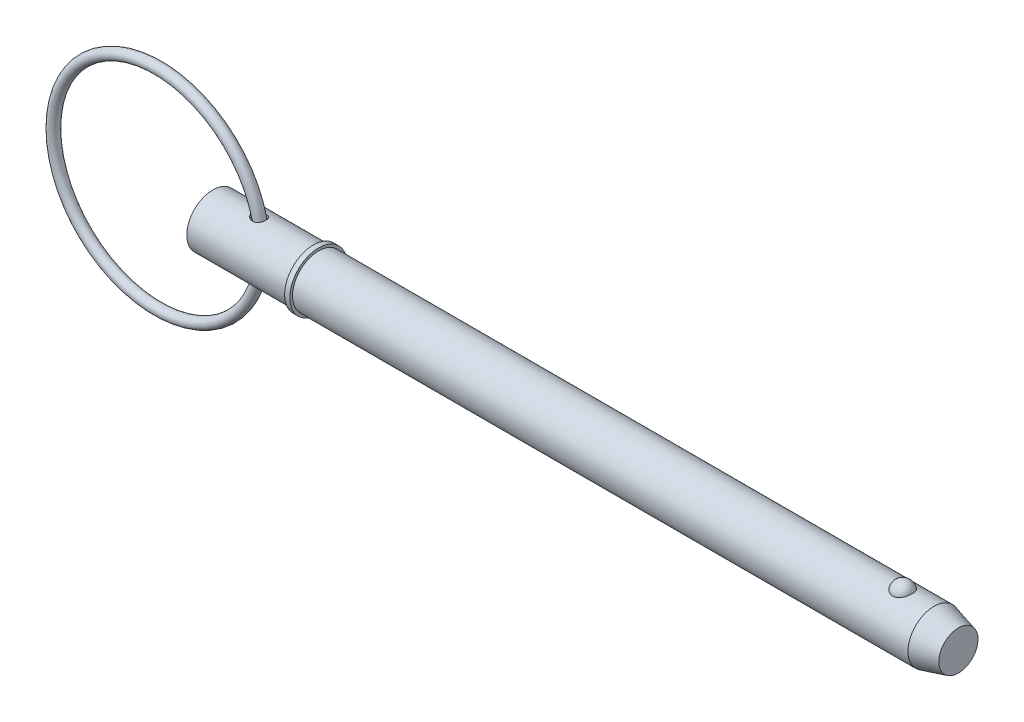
ISO-10303-21;
HEADER;
FILE_DESCRIPTION(('STEP AP214'),'2;1');
FILE_NAME('part.step','',(''),(''),'','','');
FILE_SCHEMA(('AUTOMOTIVE_DESIGN { 1 0 10303 214 1 1 1 1 }'));
ENDSEC;
DATA;
#1=APPLICATION_CONTEXT('core data for automotive mechanical design processes');
#2=APPLICATION_PROTOCOL_DEFINITION('international standard','automotive_design',2000,#1);
#3=PRODUCT_CONTEXT('',#1,'mechanical');
#4=PRODUCT('Part','Part','',(#3));
#5=PRODUCT_RELATED_PRODUCT_CATEGORY('part','',(#4));
#6=PRODUCT_DEFINITION_FORMATION('','',#4);
#7=PRODUCT_DEFINITION_CONTEXT('part definition',#1,'design');
#8=PRODUCT_DEFINITION('design','',#6,#7);
#9=PRODUCT_DEFINITION_SHAPE('','',#8);
#10=(LENGTH_UNIT() NAMED_UNIT(*) SI_UNIT(.MILLI.,.METRE.));
#11=(NAMED_UNIT(*) PLANE_ANGLE_UNIT() SI_UNIT($,.RADIAN.));
#12=(NAMED_UNIT(*) SI_UNIT($,.STERADIAN.) SOLID_ANGLE_UNIT());
#13=UNCERTAINTY_MEASURE_WITH_UNIT(LENGTH_MEASURE(1.E-05),#10,'distance_accuracy_value','');
#14=(GEOMETRIC_REPRESENTATION_CONTEXT(3) GLOBAL_UNCERTAINTY_ASSIGNED_CONTEXT((#13)) GLOBAL_UNIT_ASSIGNED_CONTEXT((#10,
#11,#12)) REPRESENTATION_CONTEXT('',''));
#15=CARTESIAN_POINT('',(0.,0.,0.));
#16=DIRECTION('',(0.,0.,1.));
#17=DIRECTION('',(1.,0.,0.));
#18=AXIS2_PLACEMENT_3D('',#15,#16,#17);
#19=CARTESIAN_POINT('',(-13.3798047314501,0.,0.));
#20=DIRECTION('',(0.,0.,1.));
#21=DIRECTION('',(1.,0.,0.));
#22=AXIS2_PLACEMENT_3D('',#19,#20,#21);
#23=TOROIDAL_SURFACE('',#22,25.4,1.27);
#24=CARTESIAN_POINT('',(13.2901952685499,0.,0.));
#25=VERTEX_POINT('',#24);
#26=VERTEX_LOOP('',#25);
#27=FACE_BOUND('',#26,.T.);
#28=ADVANCED_FACE('P0_F12',(#27),#23,.T.);
#29=CLOSED_SHELL('',(#28));
#30=MANIFOLD_SOLID_BREP('P0_B1',#29);
#31=CARTESIAN_POINT('',(0.,0.,0.));
#32=DIRECTION('',(1.,0.,0.));
#33=DIRECTION('',(0.,0.,-1.));
#34=AXIS2_PLACEMENT_3D('',#31,#32,#33);
#35=CYLINDRICAL_SURFACE('',#34,6.35);
#36=CARTESIAN_POINT('',(9.67500140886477,6.32698634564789,-0.540133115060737));
#37=CARTESIAN_POINT('',(9.70878953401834,6.3197498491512,-0.624879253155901));
#38=CARTESIAN_POINT('',(9.75028044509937,6.31105328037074,-0.706504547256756));
#39=CARTESIAN_POINT('',(9.84659255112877,6.29180070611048,-0.861319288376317));
#40=CARTESIAN_POINT('',(9.90144039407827,6.28124099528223,-0.934491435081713));
#41=CARTESIAN_POINT('',(10.021999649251,6.25949497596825,-1.0704877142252));
#42=CARTESIAN_POINT('',(10.0876589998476,6.2483118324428,-1.13335868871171));
#43=CARTESIAN_POINT('',(10.2280180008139,6.22641783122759,-1.24805262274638));
#44=CARTESIAN_POINT('',(10.3027159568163,6.21570688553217,-1.29987764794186));
#45=CARTESIAN_POINT('',(10.4650889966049,6.19509606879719,-1.39492899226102));
#46=CARTESIAN_POINT('',(10.5533142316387,6.1853135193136,-1.4372443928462));
#47=CARTESIAN_POINT('',(10.7357818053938,6.16871128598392,-1.50691441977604));
#48=CARTESIAN_POINT('',(10.8300253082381,6.16189217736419,-1.53426614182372));
#49=CARTESIAN_POINT('',(11.0227953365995,6.15211299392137,-1.57302798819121));
#50=CARTESIAN_POINT('',(11.1213511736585,6.14918579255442,-1.58430237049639));
#51=CARTESIAN_POINT('',(11.3189518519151,6.1478413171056,-1.58951619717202));
#52=CARTESIAN_POINT('',(11.417996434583,6.14942187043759,-1.58346399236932));
#53=CARTESIAN_POINT('',(11.6070859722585,6.15678569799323,-1.55457003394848));
#54=CARTESIAN_POINT('',(11.6973059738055,6.16229943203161,-1.53280404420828));
#55=CARTESIAN_POINT('',(11.8723373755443,6.17663058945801,-1.4739892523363));
#56=CARTESIAN_POINT('',(11.9571502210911,6.185447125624,-1.43694455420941));
#57=CARTESIAN_POINT('',(12.1146737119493,6.20482821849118,-1.35072170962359));
#58=CARTESIAN_POINT('',(12.1877743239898,6.21528554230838,-1.30222952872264));
#59=CARTESIAN_POINT('',(12.3246187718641,6.23705116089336,-1.19362916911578));
#60=CARTESIAN_POINT('',(12.3883628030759,6.24835943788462,-1.1335212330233));
#61=CARTESIAN_POINT('',(12.5046662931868,6.27053957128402,-1.00357204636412));
#62=CARTESIAN_POINT('',(12.5572571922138,6.28141258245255,-0.933759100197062));
#63=CARTESIAN_POINT('',(12.6502125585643,6.30157953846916,-0.786214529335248));
#64=CARTESIAN_POINT('',(12.6905764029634,6.31087340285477,-0.708482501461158));
#65=CARTESIAN_POINT('',(12.7585531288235,6.32699259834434,-0.546246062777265));
#66=CARTESIAN_POINT('',(12.7860022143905,6.33378599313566,-0.46166981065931));
#67=CARTESIAN_POINT('',(12.8267605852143,6.34401050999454,-0.288980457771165));
#68=CARTESIAN_POINT('',(12.8400695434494,6.34744155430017,-0.200867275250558));
#69=CARTESIAN_POINT('',(12.8522644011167,6.35058177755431,-0.023194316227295));
#70=CARTESIAN_POINT('',(12.8510870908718,6.35027464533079,0.0663700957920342));
#71=CARTESIAN_POINT('',(12.8341831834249,6.34593169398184,0.244024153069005));
#72=CARTESIAN_POINT('',(12.8184563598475,6.341895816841,0.332113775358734));
#73=CARTESIAN_POINT('',(12.7728208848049,6.33052992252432,0.504322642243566));
#74=CARTESIAN_POINT('',(12.7429114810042,6.32319973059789,0.58844167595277));
#75=CARTESIAN_POINT('',(12.6696162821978,6.30604116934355,0.750316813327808));
#76=CARTESIAN_POINT('',(12.6262302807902,6.29621276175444,0.828072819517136));
#77=CARTESIAN_POINT('',(12.5270856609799,6.27515240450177,0.974918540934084));
#78=CARTESIAN_POINT('',(12.4713403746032,6.26392197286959,1.04401746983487));
#79=CARTESIAN_POINT('',(12.3488662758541,6.24131002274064,1.1716478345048));
#80=CARTESIAN_POINT('',(12.2821384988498,6.22992851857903,1.23018026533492));
#81=CARTESIAN_POINT('',(12.1401870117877,6.20841765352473,1.33449214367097));
#82=CARTESIAN_POINT('',(12.0650507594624,6.19827734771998,1.38038832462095));
#83=CARTESIAN_POINT('',(11.9079044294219,6.18026478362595,1.45892404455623));
#84=CARTESIAN_POINT('',(11.8258951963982,6.17239224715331,1.49156520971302));
#85=CARTESIAN_POINT('',(11.6581736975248,6.15982613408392,1.54263810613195));
#86=CARTESIAN_POINT('',(11.572502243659,6.15510409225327,1.56119728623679));
#87=CARTESIAN_POINT('',(11.3991899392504,6.14916283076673,1.58443707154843));
#88=CARTESIAN_POINT('',(11.3115488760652,6.14794399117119,1.58911617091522));
#89=CARTESIAN_POINT('',(11.1345547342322,6.14904466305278,1.58485137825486));
#90=CARTESIAN_POINT('',(11.0452104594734,6.15144894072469,1.5755811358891));
#91=CARTESIAN_POINT('',(10.8691479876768,6.15957601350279,1.54349959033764));
#92=CARTESIAN_POINT('',(10.782430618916,6.16529984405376,1.52068406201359));
#93=CARTESIAN_POINT('',(10.6082848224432,6.17983892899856,1.4605156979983));
#94=CARTESIAN_POINT('',(10.5211557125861,6.1888262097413,1.42233764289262));
#95=CARTESIAN_POINT('',(10.3542377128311,6.20874782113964,1.33268652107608));
#96=CARTESIAN_POINT('',(10.2744521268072,6.21968302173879,1.28120750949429));
#97=CARTESIAN_POINT('',(10.120854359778,6.24282707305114,1.16334748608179));
#98=CARTESIAN_POINT('',(10.0474902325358,6.25507146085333,1.09638652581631));
#99=CARTESIAN_POINT('',(9.9136869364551,6.27890019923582,0.950453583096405));
#100=CARTESIAN_POINT('',(9.85324511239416,6.29048468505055,0.871484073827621));
#101=CARTESIAN_POINT('',(9.75037543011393,6.31102161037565,0.707140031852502));
#102=CARTESIAN_POINT('',(9.70726585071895,6.32006820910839,0.622206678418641));
#103=CARTESIAN_POINT('',(9.63775895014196,6.33497125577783,0.445490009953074));
#104=CARTESIAN_POINT('',(9.61134627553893,6.34083063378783,0.35371307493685));
#105=CARTESIAN_POINT('',(9.57891955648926,6.34807071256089,0.177220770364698));
#106=CARTESIAN_POINT('',(9.57093524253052,6.3498832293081,0.0928817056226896));
#107=CARTESIAN_POINT('',(9.56994851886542,6.35010532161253,-0.0758268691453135));
#108=CARTESIAN_POINT('',(9.57692695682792,6.34851924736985,-0.160196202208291));
#109=CARTESIAN_POINT('',(9.59985709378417,6.34339435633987,-0.294043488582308));
#110=CARTESIAN_POINT('',(9.61128951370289,6.34084912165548,-0.344385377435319));
#111=CARTESIAN_POINT('',(9.63933183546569,6.33468615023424,-0.443526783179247));
#112=CARTESIAN_POINT('',(9.65594100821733,6.33106856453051,-0.492326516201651));
#113=CARTESIAN_POINT('',(9.67500140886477,6.32698634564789,-0.540133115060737));
#114=B_SPLINE_CURVE_WITH_KNOTS('',3,(#36,#37,#38,#39,#40,#41,#42,#43,#44,#45,#46,#47,#48,#49,
#50,#51,#52,#53,#54,#55,#56,#57,#58,#59,#60,#61,#62,#63,#64,#65,#66,#67,#68,#69,#70,#71,#72,#73,
#74,#75,#76,#77,#78,#79,#80,#81,#82,#83,#84,#85,#86,#87,#88,#89,#90,#91,#92,#93,#94,#95,#96,#97,
#98,#99,#100,#101,#102,#103,#104,#105,#106,#107,#108,#109,#110,#111,#112,#113),.UNSPECIFIED.,
.T.,.F.,(4,2,2,2,2,2,2,2,2,2,2,2,2,2,2,2,2,2,2,2,2,2,2,2,2,2,2,2,2,2,2,2,2,2,2,2,2,2,4),(0.,
0.274348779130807,0.549249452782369,0.822863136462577,1.09642560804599,1.39007706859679,
1.68378550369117,1.97995934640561,2.27599046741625,2.55347281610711,2.83088067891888,
3.09465189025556,3.35841759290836,3.62142956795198,3.88445494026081,4.1507318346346,
4.4170148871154,4.68446025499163,4.95190978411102,5.21937350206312,5.48684131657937,
5.75402200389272,6.02117751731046,6.28577524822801,6.55034050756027,6.81248178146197,
7.0746514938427,7.34305086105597,7.61153399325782,7.89692981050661,8.18245340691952,
8.48120635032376,8.77989784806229,9.06530254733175,9.35044442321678,9.60331609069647,
9.85586427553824,10.010650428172,10.1654147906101),.UNSPECIFIED.);
#115=CARTESIAN_POINT('',(9.67500140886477,6.32698634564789,-0.540133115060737));
#116=VERTEX_POINT('',#115);
#117=EDGE_CURVE('P1_E42',#116,#116,#114,.T.);
#118=ORIENTED_EDGE('',*,*,#117,.T.);
#119=EDGE_LOOP('',(#118));
#120=FACE_BOUND('',#119,.T.);
#121=CARTESIAN_POINT('',(0.,0.,0.));
#122=DIRECTION('',(1.,0.,0.));
#123=DIRECTION('',(0.,0.,-1.));
#124=AXIS2_PLACEMENT_3D('',#121,#122,#123);
#125=CIRCLE('',#124,6.35);
#126=CARTESIAN_POINT('',(0.,0.,-6.35));
#127=VERTEX_POINT('',#126);
#128=EDGE_CURVE('P1_E9',#127,#127,#125,.T.);
#129=ORIENTED_EDGE('',*,*,#128,.T.);
#130=EDGE_LOOP('',(#129));
#131=FACE_BOUND('',#130,.T.);
#132=CARTESIAN_POINT('',(24.43,0.,0.));
#133=DIRECTION('',(1.,0.,0.));
#134=DIRECTION('',(0.,0.,-1.));
#135=AXIS2_PLACEMENT_3D('',#132,#133,#134);
#136=CIRCLE('',#135,6.35);
#137=CARTESIAN_POINT('',(24.43,0.,-6.35));
#138=VERTEX_POINT('',#137);
#139=EDGE_CURVE('P1_E25',#138,#138,#136,.T.);
#140=ORIENTED_EDGE('',*,*,#139,.F.);
#141=EDGE_LOOP('',(#140));
#142=FACE_BOUND('',#141,.T.);
#143=CARTESIAN_POINT('',(9.67500140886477,-6.32698634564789,-0.540133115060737));
#144=CARTESIAN_POINT('',(9.64544894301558,-6.33331515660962,-0.466002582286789));
#145=CARTESIAN_POINT('',(9.62177180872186,-6.33852974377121,-0.389437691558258));
#146=CARTESIAN_POINT('',(9.58727043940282,-6.34619174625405,-0.233330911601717));
#147=CARTESIAN_POINT('',(9.57644043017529,-6.34864040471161,-0.153790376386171));
#148=CARTESIAN_POINT('',(9.56819517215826,-6.3505010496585,0.00612071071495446));
#149=CARTESIAN_POINT('',(9.57079639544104,-6.34990930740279,0.0864921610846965));
#150=CARTESIAN_POINT('',(9.58930797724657,-6.3457478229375,0.245607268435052));
#151=CARTESIAN_POINT('',(9.60522046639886,-6.34217760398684,0.324350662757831));
#152=CARTESIAN_POINT('',(9.64931570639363,-6.3324977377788,0.47727605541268));
#153=CARTESIAN_POINT('',(9.67737525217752,-6.32641361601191,0.551495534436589));
#154=CARTESIAN_POINT('',(9.74451510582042,-6.31231128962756,0.694551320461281));
#155=CARTESIAN_POINT('',(9.78359827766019,-6.30429258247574,0.763386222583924));
#156=CARTESIAN_POINT('',(9.87474700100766,-6.28638332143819,0.899414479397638));
#157=CARTESIAN_POINT('',(9.92757481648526,-6.27639669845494,0.966083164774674));
#158=CARTESIAN_POINT('',(10.042675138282,-6.25596164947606,1.09061181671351));
#159=CARTESIAN_POINT('',(10.1049521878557,-6.24551300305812,1.14846751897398));
#160=CARTESIAN_POINT('',(10.2445505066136,-6.22397505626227,1.26024641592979));
#161=CARTESIAN_POINT('',(10.3227711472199,-6.2129394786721,1.31305951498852));
#162=CARTESIAN_POINT('',(10.4867924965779,-6.19263757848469,1.40570084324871));
#163=CARTESIAN_POINT('',(10.5725962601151,-6.18337197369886,1.44552380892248));
#164=CARTESIAN_POINT('',(10.7543302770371,-6.16725983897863,1.51283687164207));
#165=CARTESIAN_POINT('',(10.8505554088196,-6.16056505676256,1.53957358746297));
#166=CARTESIAN_POINT('',(11.0463546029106,-6.15127671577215,1.57628137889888));
#167=CARTESIAN_POINT('',(11.1459276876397,-6.14868197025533,1.58625730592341));
#168=CARTESIAN_POINT('',(11.3414257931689,-6.14810798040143,1.58848000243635));
#169=CARTESIAN_POINT('',(11.4373417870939,-6.14995283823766,1.58140242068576));
#170=CARTESIAN_POINT('',(11.6262783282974,-6.1577972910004,1.55057566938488));
#171=CARTESIAN_POINT('',(11.719300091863,-6.16379511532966,1.52683360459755));
#172=CARTESIAN_POINT('',(11.8934223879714,-6.17873566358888,1.46514575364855));
#173=CARTESIAN_POINT('',(11.9749048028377,-6.18746207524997,1.42822144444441));
#174=CARTESIAN_POINT('',(12.1301362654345,-6.20693584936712,1.3410564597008));
#175=CARTESIAN_POINT('',(12.2038861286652,-6.21768299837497,1.29081719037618));
#176=CARTESIAN_POINT('',(12.3399792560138,-6.23970077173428,1.17972764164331));
#177=CARTESIAN_POINT('',(12.4025430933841,-6.25095401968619,1.11914355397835));
#178=CARTESIAN_POINT('',(12.5166805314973,-6.27296916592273,0.988307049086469));
#179=CARTESIAN_POINT('',(12.568253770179,-6.28373104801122,0.918054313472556));
#180=CARTESIAN_POINT('',(12.6596230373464,-6.3037060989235,0.769081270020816));
#181=CARTESIAN_POINT('',(12.6992956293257,-6.31290263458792,0.690283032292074));
#182=CARTESIAN_POINT('',(12.7652258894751,-6.32862394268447,0.527011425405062));
#183=CARTESIAN_POINT('',(12.7914829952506,-6.33514860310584,0.442537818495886));
#184=CARTESIAN_POINT('',(12.8301436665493,-6.34487485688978,0.269505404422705));
#185=CARTESIAN_POINT('',(12.8424230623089,-6.34804664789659,0.180917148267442));
#186=CARTESIAN_POINT('',(12.8524214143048,-6.35062347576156,0.00286829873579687));
#187=CARTESIAN_POINT('',(12.8501402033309,-6.35002846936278,-0.0865923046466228));
#188=CARTESIAN_POINT('',(12.8310619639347,-6.34513332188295,-0.263931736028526));
#189=CARTESIAN_POINT('',(12.8142517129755,-6.34082980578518,-0.35180904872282));
#190=CARTESIAN_POINT('',(12.7664911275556,-6.32897674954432,-0.523406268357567));
#191=CARTESIAN_POINT('',(12.7355404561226,-6.3214271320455,-0.607126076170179));
#192=CARTESIAN_POINT('',(12.6602298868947,-6.30390232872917,-0.768030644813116));
#193=CARTESIAN_POINT('',(12.6158695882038,-6.29392707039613,-0.84521521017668));
#194=CARTESIAN_POINT('',(12.5148171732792,-6.2726521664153,-0.990836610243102));
#195=CARTESIAN_POINT('',(12.4581254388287,-6.26135256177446,-1.05927371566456));
#196=CARTESIAN_POINT('',(12.33416419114,-6.2387572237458,-1.18510935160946));
#197=CARTESIAN_POINT('',(12.2669484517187,-6.22746174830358,-1.24256086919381));
#198=CARTESIAN_POINT('',(12.1235592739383,-6.20610255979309,-1.34519464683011));
#199=CARTESIAN_POINT('',(12.0473871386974,-6.19603866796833,-1.39037868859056));
#200=CARTESIAN_POINT('',(11.8892714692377,-6.17839642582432,-1.46678006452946));
#201=CARTESIAN_POINT('',(11.8074126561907,-6.17078838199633,-1.49816605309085));
#202=CARTESIAN_POINT('',(11.6394563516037,-6.15869606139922,-1.54712759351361));
#203=CARTESIAN_POINT('',(11.5533589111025,-6.15421174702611,-1.56470331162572));
#204=CARTESIAN_POINT('',(11.3789660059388,-6.14876652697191,-1.58596734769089));
#205=CARTESIAN_POINT('',(11.2906621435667,-6.1478222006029,-1.58959032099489));
#206=CARTESIAN_POINT('',(11.1146029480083,-6.149490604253,-1.58312110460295));
#207=CARTESIAN_POINT('',(11.0268477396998,-6.1521041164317,-1.57302589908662));
#208=CARTESIAN_POINT('',(10.8498668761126,-6.16071031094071,-1.53898332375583));
#209=CARTESIAN_POINT('',(10.7607726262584,-6.16685908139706,-1.51439468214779));
#210=CARTESIAN_POINT('',(10.5876521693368,-6.18189031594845,-1.45181305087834));
#211=CARTESIAN_POINT('',(10.5036282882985,-6.19077402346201,-1.41381396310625));
#212=CARTESIAN_POINT('',(10.3374228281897,-6.2109378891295,-1.32252480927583));
#213=CARTESIAN_POINT('',(10.255708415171,-6.2223355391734,-1.26840756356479));
#214=CARTESIAN_POINT('',(10.1025645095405,-6.24580740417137,-1.14725208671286));
#215=CARTESIAN_POINT('',(10.0311354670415,-6.25788164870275,-1.08021329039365));
#216=CARTESIAN_POINT('',(9.90472699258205,-6.2806176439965,-0.938710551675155));
#217=CARTESIAN_POINT('',(9.84904456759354,-6.29132066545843,-0.864883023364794));
#218=CARTESIAN_POINT('',(9.75129345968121,-6.31084098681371,-0.708496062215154));
#219=CARTESIAN_POINT('',(9.70921094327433,-6.31966019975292,-0.625945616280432));
#220=CARTESIAN_POINT('',(9.67500140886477,-6.32698634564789,-0.540133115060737));
#221=B_SPLINE_CURVE_WITH_KNOTS('',3,(#143,#144,#145,#146,#147,#148,#149,#150,#151,#152,#153,
#154,#155,#156,#157,#158,#159,#160,#161,#162,#163,#164,#165,#166,#167,#168,#169,#170,#171,#172,
#173,#174,#175,#176,#177,#178,#179,#180,#181,#182,#183,#184,#185,#186,#187,#188,#189,#190,#191,
#192,#193,#194,#195,#196,#197,#198,#199,#200,#201,#202,#203,#204,#205,#206,#207,#208,#209,#210,
#211,#212,#213,#214,#215,#216,#217,#218,#219,#220),.UNSPECIFIED.,.T.,.F.,(4,2,2,2,2,2,2,2,2,2,2,
2,2,2,2,2,2,2,2,2,2,2,2,2,2,2,2,2,2,2,2,2,2,2,2,2,2,2,4),(0.,0.239871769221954,
0.479635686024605,0.719693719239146,0.959790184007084,1.19750645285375,1.43528453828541,
1.69117930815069,1.94719750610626,2.23102979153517,2.51497694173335,2.81376497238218,
3.11246650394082,3.39952951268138,3.68647020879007,3.95479420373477,4.22308987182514,
4.48530700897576,4.74753278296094,5.01239119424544,5.27726070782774,5.54446524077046,
5.81167284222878,6.07912387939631,6.34658129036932,6.61404669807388,6.88150382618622,
7.14763644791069,7.41373039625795,7.67647472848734,7.93921589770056,8.20318607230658,
8.46721428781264,8.74390821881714,9.02072813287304,9.31537622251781,9.61003720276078,
9.88799314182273,10.1656654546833),.UNSPECIFIED.);
#222=CARTESIAN_POINT('',(9.67500140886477,-6.32698634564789,-0.540133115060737));
#223=VERTEX_POINT('',#222);
#224=EDGE_CURVE('P1_E17',#223,#223,#221,.T.);
#225=ORIENTED_EDGE('',*,*,#224,.T.);
#226=EDGE_LOOP('',(#225));
#227=FACE_BOUND('',#226,.T.);
#228=ADVANCED_FACE('P1_F13',(#120,#131,#142,#227),#35,.T.);
#229=CARTESIAN_POINT('',(0.,0.,0.));
#230=DIRECTION('',(1.,0.,0.));
#231=DIRECTION('',(0.,0.,-1.));
#232=AXIS2_PLACEMENT_3D('',#229,#230,#231);
#233=CYLINDRICAL_SURFACE('',#232,6.35);
#234=CARTESIAN_POINT('',(175.355369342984,0.,0.));
#235=DIRECTION('',(1.,0.,0.));
#236=DIRECTION('',(0.,0.,-1.));
#237=AXIS2_PLACEMENT_3D('',#234,#235,#236);
#238=CIRCLE('',#237,6.35);
#239=CARTESIAN_POINT('',(175.355369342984,0.,-6.35));
#240=VERTEX_POINT('',#239);
#241=EDGE_CURVE('P1_E99',#240,#240,#238,.T.);
#242=ORIENTED_EDGE('',*,*,#241,.F.);
#243=EDGE_LOOP('',(#242));
#244=FACE_BOUND('',#243,.T.);
#245=CARTESIAN_POINT('',(25.7,0.,0.));
#246=DIRECTION('',(1.,0.,0.));
#247=DIRECTION('',(0.,0.,-1.));
#248=AXIS2_PLACEMENT_3D('',#245,#246,#247);
#249=CIRCLE('',#248,6.35);
#250=CARTESIAN_POINT('',(25.7,0.,-6.35));
#251=VERTEX_POINT('',#250);
#252=EDGE_CURVE('P1_E96',#251,#251,#249,.T.);
#253=ORIENTED_EDGE('',*,*,#252,.T.);
#254=EDGE_LOOP('',(#253));
#255=FACE_BOUND('',#254,.T.);
#256=CARTESIAN_POINT('',(167.730021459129,5.87502187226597,2.40969251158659));
#257=CARTESIAN_POINT('',(167.605030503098,5.87501645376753,2.40969773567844));
#258=CARTESIAN_POINT('',(167.480080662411,5.87916061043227,2.39967292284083));
#259=CARTESIAN_POINT('',(167.233909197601,5.8952311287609,2.35991730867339));
#260=CARTESIAN_POINT('',(167.112686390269,5.90715499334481,2.33019283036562));
#261=CARTESIAN_POINT('',(166.877517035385,5.93739567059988,2.25201402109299));
#262=CARTESIAN_POINT('',(166.763560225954,5.95570321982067,2.20358681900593));
#263=CARTESIAN_POINT('',(166.54557352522,5.9967206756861,2.08937987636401));
#264=CARTESIAN_POINT('',(166.441545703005,6.01943149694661,2.02359652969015));
#265=CARTESIAN_POINT('',(166.242943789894,6.06760647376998,1.87428969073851));
#266=CARTESIAN_POINT('',(166.148726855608,6.09313095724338,1.79031110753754));
#267=CARTESIAN_POINT('',(165.975255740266,6.14375873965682,1.60800178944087));
#268=CARTESIAN_POINT('',(165.896004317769,6.16886196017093,1.50966841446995));
#269=CARTESIAN_POINT('',(165.750845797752,6.21724600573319,1.29645884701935));
#270=CARTESIAN_POINT('',(165.685688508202,6.24039621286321,1.18104158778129));
#271=CARTESIAN_POINT('',(165.574703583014,6.28117277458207,0.940351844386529));
#272=CARTESIAN_POINT('',(165.528877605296,6.29879865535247,0.81507851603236));
#273=CARTESIAN_POINT('',(165.457023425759,6.32692073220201,0.556494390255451));
#274=CARTESIAN_POINT('',(165.431249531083,6.33732517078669,0.423102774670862));
#275=CARTESIAN_POINT('',(165.400988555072,6.34957673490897,0.15354272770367));
#276=CARTESIAN_POINT('',(165.396500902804,6.35142408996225,0.0173743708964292));
#277=CARTESIAN_POINT('',(165.408865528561,6.34638925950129,-0.253036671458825));
#278=CARTESIAN_POINT('',(165.425594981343,6.33955731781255,-0.387285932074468));
#279=CARTESIAN_POINT('',(165.479843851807,6.31794129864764,-0.650851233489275));
#280=CARTESIAN_POINT('',(165.517363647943,6.30315707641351,-0.780167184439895));
#281=CARTESIAN_POINT('',(165.612500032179,6.26711642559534,-1.03041949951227));
#282=CARTESIAN_POINT('',(165.670143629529,6.24585130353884,-1.1513443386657));
#283=CARTESIAN_POINT('',(165.804352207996,6.19905619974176,-1.38129800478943));
#284=CARTESIAN_POINT('',(165.880918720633,6.17352587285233,-1.49032586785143));
#285=CARTESIAN_POINT('',(166.051753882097,6.12080227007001,-1.69393164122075));
#286=CARTESIAN_POINT('',(166.146100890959,6.09360200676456,-1.78844209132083));
#287=CARTESIAN_POINT('',(166.350119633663,6.04070434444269,-1.95970536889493));
#288=CARTESIAN_POINT('',(166.459790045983,6.01500681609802,-2.03645972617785));
#289=CARTESIAN_POINT('',(166.689187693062,5.96867714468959,-2.16845644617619));
#290=CARTESIAN_POINT('',(166.808652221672,5.94794910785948,-2.22412062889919));
#291=CARTESIAN_POINT('',(167.056218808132,5.91340580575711,-2.31440992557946));
#292=CARTESIAN_POINT('',(167.184317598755,5.8995879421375,-2.3490429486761));
#293=CARTESIAN_POINT('',(167.438582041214,5.88111049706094,-2.39491590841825));
#294=CARTESIAN_POINT('',(167.564520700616,5.876025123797,-2.40724512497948));
#295=CARTESIAN_POINT('',(167.816786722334,5.87428980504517,-2.41147867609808));
#296=CARTESIAN_POINT('',(167.943114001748,5.87763817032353,-2.40338710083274));
#297=CARTESIAN_POINT('',(168.188417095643,5.89212921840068,-2.36762715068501));
#298=CARTESIAN_POINT('',(168.307499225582,5.90302431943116,-2.34058030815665));
#299=CARTESIAN_POINT('',(168.53924472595,5.93113752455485,-2.26839066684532));
#300=CARTESIAN_POINT('',(168.651907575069,5.94835614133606,-2.22324640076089));
#301=CARTESIAN_POINT('',(168.870400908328,5.98773016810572,-2.11493806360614));
#302=CARTESIAN_POINT('',(168.976028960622,6.00998499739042,-2.05140269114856));
#303=CARTESIAN_POINT('',(169.175300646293,6.05690144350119,-1.90842705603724));
#304=CARTESIAN_POINT('',(169.268941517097,6.08156361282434,-1.82898313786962));
#305=CARTESIAN_POINT('',(169.446675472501,6.13211715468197,-1.65182429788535));
#306=CARTESIAN_POINT('',(169.530055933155,6.15800825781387,-1.55339381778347));
#307=CARTESIAN_POINT('',(169.679790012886,6.20712834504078,-1.34374214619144));
#308=CARTESIAN_POINT('',(169.746140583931,6.23035685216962,-1.23251867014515));
#309=CARTESIAN_POINT('',(169.862345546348,6.27251177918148,-0.996447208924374));
#310=CARTESIAN_POINT('',(169.911607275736,6.29127762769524,-0.871278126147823));
#311=CARTESIAN_POINT('',(169.989614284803,6.3215862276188,-0.613870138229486));
#312=CARTESIAN_POINT('',(170.018359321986,6.33312889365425,-0.481631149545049));
#313=CARTESIAN_POINT('',(170.05477058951,6.34782349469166,-0.213672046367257));
#314=CARTESIAN_POINT('',(170.062413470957,6.35096613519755,-0.0779482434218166));
#315=CARTESIAN_POINT('',(170.056395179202,6.34851322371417,0.192943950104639));
#316=CARTESIAN_POINT('',(170.042734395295,6.3429178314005,0.328112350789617));
#317=CARTESIAN_POINT('',(169.99450361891,6.32360512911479,0.593406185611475));
#318=CARTESIAN_POINT('',(169.960031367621,6.30992579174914,0.7235521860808));
#319=CARTESIAN_POINT('',(169.870953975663,6.27586325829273,0.975834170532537));
#320=CARTESIAN_POINT('',(169.81634761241,6.25547965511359,1.09796966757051));
#321=CARTESIAN_POINT('',(169.68775879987,6.20998183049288,1.33148921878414));
#322=CARTESIAN_POINT('',(169.613674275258,6.18484288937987,1.44281227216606));
#323=CARTESIAN_POINT('',(169.447820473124,6.13258735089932,1.65087683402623));
#324=CARTESIAN_POINT('',(169.356051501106,6.10547078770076,1.74761859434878));
#325=CARTESIAN_POINT('',(169.157183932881,6.05235879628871,1.92350926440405));
#326=CARTESIAN_POINT('',(169.050133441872,6.0263601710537,2.00271146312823));
#327=CARTESIAN_POINT('',(168.823138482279,5.97843747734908,2.1415415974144));
#328=CARTESIAN_POINT('',(168.703191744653,5.95651412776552,2.20116608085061));
#329=CARTESIAN_POINT('',(168.444523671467,5.91812106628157,2.30250570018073));
#330=CARTESIAN_POINT('',(168.30506980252,5.90217533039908,2.34256795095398));
#331=CARTESIAN_POINT('',(168.020397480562,5.88063128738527,2.39615214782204));
#332=CARTESIAN_POINT('',(167.87518174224,5.8750281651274,2.40968644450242));
#333=CARTESIAN_POINT('',(167.730021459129,5.87502187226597,2.40969251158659));
#334=B_SPLINE_CURVE_WITH_KNOTS('',3,(#256,#257,#258,#259,#260,#261,#262,#263,#264,#265,#266,
#267,#268,#269,#270,#271,#272,#273,#274,#275,#276,#277,#278,#279,#280,#281,#282,#283,#284,#285,
#286,#287,#288,#289,#290,#291,#292,#293,#294,#295,#296,#297,#298,#299,#300,#301,#302,#303,#304,
#305,#306,#307,#308,#309,#310,#311,#312,#313,#314,#315,#316,#317,#318,#319,#320,#321,#322,#323,
#324,#325,#326,#327,#328,#329,#330,#331,#332,#333),.UNSPECIFIED.,.T.,.F.,(4,2,2,2,2,2,2,2,2,2,2,
2,2,2,2,2,2,2,2,2,2,2,2,2,2,2,2,2,2,2,2,2,2,2,2,2,2,2,4),(0.,0.374440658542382,
0.748761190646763,1.1225407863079,1.49639810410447,1.88098871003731,2.2656501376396,
2.6674110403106,3.06920639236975,3.47601794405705,3.88281858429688,4.28727498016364,
4.69173873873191,5.09674745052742,5.50178895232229,5.90865911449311,6.31549420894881,
6.71369855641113,7.11175305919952,7.48978077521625,7.86773278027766,8.23383886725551,
8.59997464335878,8.97409044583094,9.34829231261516,9.7412266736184,10.1342313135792,
10.5397522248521,10.9452779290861,11.3512521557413,11.7572189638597,12.1612938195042,
12.5653932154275,12.9716540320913,13.3779078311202,13.7829098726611,14.1879832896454,
14.6230486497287,15.0579114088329),.UNSPECIFIED.);
#335=CARTESIAN_POINT('',(167.730021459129,5.87502187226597,2.40969251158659));
#336=VERTEX_POINT('',#335);
#337=EDGE_CURVE('P1_E34',#336,#336,#334,.T.);
#338=ORIENTED_EDGE('',*,*,#337,.T.);
#339=EDGE_LOOP('',(#338));
#340=FACE_BOUND('',#339,.T.);
#341=ADVANCED_FACE('P1_F46',(#244,#255,#340),#233,.T.);
#342=CARTESIAN_POINT('',(0.,0.,0.));
#343=DIRECTION('',(-1.,0.,0.));
#344=DIRECTION('',(0.,0.,1.));
#345=AXIS2_PLACEMENT_3D('',#342,#343,#344);
#346=PLANE('',#345);
#347=ORIENTED_EDGE('',*,*,#128,.F.);
#348=EDGE_LOOP('',(#347));
#349=FACE_BOUND('',#348,.T.);
#350=ADVANCED_FACE('P1_F15',(#349),#346,.T.);
#351=CARTESIAN_POINT('',(24.43,6.35,0.));
#352=DIRECTION('',(-1.,0.,0.));
#353=DIRECTION('',(0.,0.,1.));
#354=AXIS2_PLACEMENT_3D('',#351,#352,#353);
#355=PLANE('',#354);
#356=ORIENTED_EDGE('',*,*,#139,.T.);
#357=EDGE_LOOP('',(#356));
#358=FACE_BOUND('',#357,.T.);
#359=CARTESIAN_POINT('',(24.43,0.,0.));
#360=DIRECTION('',(1.,0.,0.));
#361=DIRECTION('',(0.,0.,-1.));
#362=AXIS2_PLACEMENT_3D('',#359,#360,#361);
#363=CIRCLE('',#362,6.985);
#364=CARTESIAN_POINT('',(24.43,0.,-6.985));
#365=VERTEX_POINT('',#364);
#366=EDGE_CURVE('P1_E30',#365,#365,#363,.T.);
#367=ORIENTED_EDGE('',*,*,#366,.F.);
#368=EDGE_LOOP('',(#367));
#369=FACE_BOUND('',#368,.T.);
#370=ADVANCED_FACE('P1_F81',(#358,#369),#355,.T.);
#371=CARTESIAN_POINT('',(0.,0.,0.));
#372=DIRECTION('',(1.,0.,0.));
#373=DIRECTION('',(0.,0.,-1.));
#374=AXIS2_PLACEMENT_3D('',#371,#372,#373);
#375=CYLINDRICAL_SURFACE('',#374,6.985);
#376=ORIENTED_EDGE('',*,*,#366,.T.);
#377=EDGE_LOOP('',(#376));
#378=FACE_BOUND('',#377,.T.);
#379=CARTESIAN_POINT('',(25.7,0.,0.));
#380=DIRECTION('',(1.,0.,0.));
#381=DIRECTION('',(0.,0.,-1.));
#382=AXIS2_PLACEMENT_3D('',#379,#380,#381);
#383=CIRCLE('',#382,6.985);
#384=CARTESIAN_POINT('',(25.7,0.,-6.985));
#385=VERTEX_POINT('',#384);
#386=EDGE_CURVE('P1_E95',#385,#385,#383,.T.);
#387=ORIENTED_EDGE('',*,*,#386,.F.);
#388=EDGE_LOOP('',(#387));
#389=FACE_BOUND('',#388,.T.);
#390=ADVANCED_FACE('P1_F68',(#378,#389),#375,.T.);
#391=CARTESIAN_POINT('',(25.7,6.985,0.));
#392=DIRECTION('',(1.,0.,0.));
#393=DIRECTION('',(0.,0.,-1.));
#394=AXIS2_PLACEMENT_3D('',#391,#392,#393);
#395=PLANE('',#394);
#396=ORIENTED_EDGE('',*,*,#386,.T.);
#397=EDGE_LOOP('',(#396));
#398=FACE_BOUND('',#397,.T.);
#399=ORIENTED_EDGE('',*,*,#252,.F.);
#400=EDGE_LOOP('',(#399));
#401=FACE_BOUND('',#400,.T.);
#402=ADVANCED_FACE('P1_F62',(#398,#401),#395,.T.);
#403=CARTESIAN_POINT('',(181.28,0.,0.));
#404=DIRECTION('',(-1.,0.,0.));
#405=DIRECTION('',(0.,0.,1.));
#406=AXIS2_PLACEMENT_3D('',#403,#404,#405);
#407=CONICAL_SURFACE('',#406,4.76250000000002,0.261799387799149);
#408=ORIENTED_EDGE('',*,*,#241,.T.);
#409=EDGE_LOOP('',(#408));
#410=FACE_BOUND('',#409,.T.);
#411=CARTESIAN_POINT('',(181.28,0.,0.));
#412=DIRECTION('',(1.,0.,0.));
#413=DIRECTION('',(0.,0.,-1.));
#414=AXIS2_PLACEMENT_3D('',#411,#412,#413);
#415=CIRCLE('',#414,4.76250000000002);
#416=CARTESIAN_POINT('',(181.28,0.,-4.76250000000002));
#417=VERTEX_POINT('',#416);
#418=EDGE_CURVE('P1_E41',#417,#417,#415,.T.);
#419=ORIENTED_EDGE('',*,*,#418,.F.);
#420=EDGE_LOOP('',(#419));
#421=FACE_BOUND('',#420,.T.);
#422=ADVANCED_FACE('P1_F59',(#410,#421),#407,.T.);
#423=CARTESIAN_POINT('',(181.28,4.76250000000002,0.));
#424=DIRECTION('',(1.,0.,0.));
#425=DIRECTION('',(0.,0.,-1.));
#426=AXIS2_PLACEMENT_3D('',#423,#424,#425);
#427=PLANE('',#426);
#428=ORIENTED_EDGE('',*,*,#418,.T.);
#429=EDGE_LOOP('',(#428));
#430=FACE_BOUND('',#429,.T.);
#431=ADVANCED_FACE('P1_F55',(#430),#427,.T.);
#432=CARTESIAN_POINT('',(167.730021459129,5.715,0.));
#433=DIRECTION('',(-1.,0.,0.));
#434=DIRECTION('',(0.,1.,0.));
#435=AXIS2_PLACEMENT_3D('',#432,#433,#434);
#436=SPHERICAL_SURFACE('',#435,2.415);
#437=ORIENTED_EDGE('',*,*,#337,.F.);
#438=EDGE_LOOP('',(#437));
#439=FACE_BOUND('',#438,.T.);
#440=ADVANCED_FACE('P1_F50',(#439),#436,.T.);
#441=CARTESIAN_POINT('',(-13.3798047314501,0.,0.));
#442=DIRECTION('',(0.,0.,1.));
#443=DIRECTION('',(1.,0.,0.));
#444=AXIS2_PLACEMENT_3D('',#441,#442,#443);
#445=TOROIDAL_SURFACE('',#444,25.4,1.5875);
#446=ORIENTED_EDGE('',*,*,#224,.F.);
#447=EDGE_LOOP('',(#446));
#448=FACE_BOUND('',#447,.T.);
#449=ORIENTED_EDGE('',*,*,#117,.F.);
#450=EDGE_LOOP('',(#449));
#451=FACE_BOUND('',#450,.T.);
#452=ADVANCED_FACE('P1_F54',(#448,#451),#445,.F.);
#453=CLOSED_SHELL('',(#228,#341,#350,#370,#390,#402,#422,#431,#440,#452));
#454=MANIFOLD_SOLID_BREP('P1_B1',#453);
#455=ADVANCED_BREP_SHAPE_REPRESENTATION('',(#18,#30,#454),#14);
#456=SHAPE_DEFINITION_REPRESENTATION(#9,#455);
ENDSEC;
END-ISO-10303-21;
